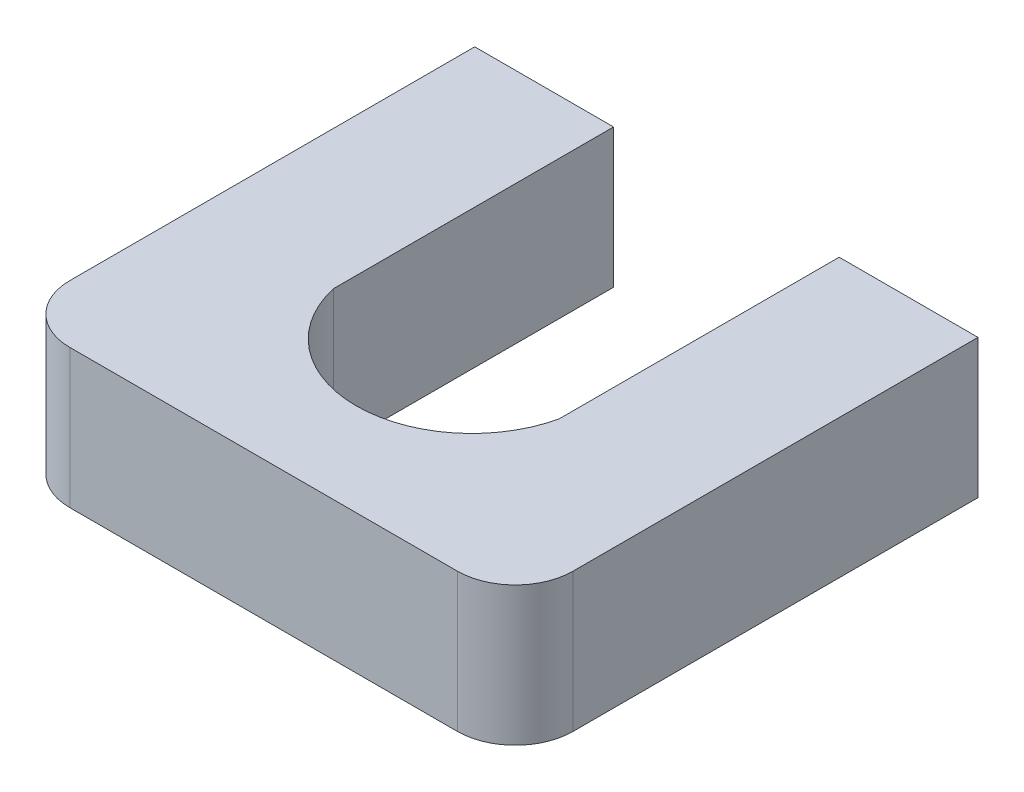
ISO-10303-21;
HEADER;
FILE_DESCRIPTION(('STEP AP214'),'2;1');
FILE_NAME('part.step','',(''),(''),'','','');
FILE_SCHEMA(('AUTOMOTIVE_DESIGN { 1 0 10303 214 1 1 1 1 }'));
ENDSEC;
DATA;
#1=APPLICATION_CONTEXT('core data for automotive mechanical design processes');
#2=APPLICATION_PROTOCOL_DEFINITION('international standard','automotive_design',2000,#1);
#3=PRODUCT_CONTEXT('',#1,'mechanical');
#4=PRODUCT('Part','Part','',(#3));
#5=PRODUCT_RELATED_PRODUCT_CATEGORY('part','',(#4));
#6=PRODUCT_DEFINITION_FORMATION('','',#4);
#7=PRODUCT_DEFINITION_CONTEXT('part definition',#1,'design');
#8=PRODUCT_DEFINITION('design','',#6,#7);
#9=PRODUCT_DEFINITION_SHAPE('','',#8);
#10=(LENGTH_UNIT() NAMED_UNIT(*) SI_UNIT(.MILLI.,.METRE.));
#11=(NAMED_UNIT(*) PLANE_ANGLE_UNIT() SI_UNIT($,.RADIAN.));
#12=(NAMED_UNIT(*) SI_UNIT($,.STERADIAN.) SOLID_ANGLE_UNIT());
#13=UNCERTAINTY_MEASURE_WITH_UNIT(LENGTH_MEASURE(1.E-05),#10,'distance_accuracy_value','');
#14=(GEOMETRIC_REPRESENTATION_CONTEXT(3) GLOBAL_UNCERTAINTY_ASSIGNED_CONTEXT((#13)) GLOBAL_UNIT_ASSIGNED_CONTEXT((#10,
#11,#12)) REPRESENTATION_CONTEXT('',''));
#15=CARTESIAN_POINT('',(0.,0.,0.));
#16=DIRECTION('',(0.,0.,1.));
#17=DIRECTION('',(1.,0.,0.));
#18=AXIS2_PLACEMENT_3D('',#15,#16,#17);
#19=CARTESIAN_POINT('',(-5.75,-6.,0.));
#20=DIRECTION('',(0.,0.,1.));
#21=DIRECTION('',(0.,-1.,0.));
#22=AXIS2_PLACEMENT_3D('',#19,#20,#21);
#23=PLANE('',#22);
#24=CARTESIAN_POINT('',(0.,0.,0.));
#25=DIRECTION('',(0.,0.,-1.));
#26=DIRECTION('',(-1.,0.,0.));
#27=AXIS2_PLACEMENT_3D('',#24,#25,#26);
#28=CIRCLE('',#27,2.5);
#29=CARTESIAN_POINT('',(-2.5,0.,0.));
#30=VERTEX_POINT('',#29);
#31=EDGE_CURVE('E248',#30,#30,#28,.T.);
#32=ORIENTED_EDGE('',*,*,#31,.F.);
#33=EDGE_LOOP('',(#32));
#34=FACE_BOUND('',#33,.T.);
#35=DIRECTION('',(0.,1.,0.));
#36=VECTOR('',#35,1.);
#37=CARTESIAN_POINT('',(6.25,-6.,0.));
#38=LINE('',#37,#36);
#39=CARTESIAN_POINT('',(6.25,-6.,0.));
#40=VERTEX_POINT('',#39);
#41=CARTESIAN_POINT('',(6.25,6.,0.));
#42=VERTEX_POINT('',#41);
#43=EDGE_CURVE('E168',#40,#42,#38,.T.);
#44=ORIENTED_EDGE('',*,*,#43,.F.);
#45=DIRECTION('',(1.,0.,0.));
#46=VECTOR('',#45,1.);
#47=CARTESIAN_POINT('',(-5.75,-6.,0.));
#48=LINE('',#47,#46);
#49=CARTESIAN_POINT('',(-5.75,-6.,0.));
#50=VERTEX_POINT('',#49);
#51=EDGE_CURVE('E144',#50,#40,#48,.T.);
#52=ORIENTED_EDGE('',*,*,#51,.F.);
#53=DIRECTION('',(0.,1.,0.));
#54=VECTOR('',#53,1.);
#55=CARTESIAN_POINT('',(-5.75,-6.,0.));
#56=LINE('',#55,#54);
#57=CARTESIAN_POINT('',(-5.75,6.,0.));
#58=VERTEX_POINT('',#57);
#59=EDGE_CURVE('E170',#50,#58,#56,.T.);
#60=ORIENTED_EDGE('',*,*,#59,.T.);
#61=DIRECTION('',(1.,0.,0.));
#62=VECTOR('',#61,1.);
#63=CARTESIAN_POINT('',(-5.75,6.,0.));
#64=LINE('',#63,#62);
#65=EDGE_CURVE('E118',#58,#42,#64,.T.);
#66=ORIENTED_EDGE('',*,*,#65,.T.);
#67=EDGE_LOOP('',(#44,#52,#60,#66));
#68=FACE_BOUND('',#67,.T.);
#69=ADVANCED_FACE('F14',(#34,#68),#23,.F.);
#70=CARTESIAN_POINT('',(32.75,-6.,35.));
#71=DIRECTION('',(0.,1.,0.));
#72=DIRECTION('',(-1.,0.,0.));
#73=AXIS2_PLACEMENT_3D('',#70,#71,#72);
#74=CYLINDRICAL_SURFACE('',#73,5.);
#75=DIRECTION('',(0.,1.,0.));
#76=VECTOR('',#75,1.);
#77=CARTESIAN_POINT('',(32.75,-6.,40.));
#78=LINE('',#77,#76);
#79=CARTESIAN_POINT('',(32.75,-6.,40.));
#80=VERTEX_POINT('',#79);
#81=CARTESIAN_POINT('',(32.75,6.,40.));
#82=VERTEX_POINT('',#81);
#83=EDGE_CURVE('E9',#80,#82,#78,.T.);
#84=ORIENTED_EDGE('',*,*,#83,.F.);
#85=CARTESIAN_POINT('',(32.75,-6.,35.));
#86=DIRECTION('',(0.,-1.,0.));
#87=DIRECTION('',(1.,0.,0.));
#88=AXIS2_PLACEMENT_3D('',#85,#86,#87);
#89=CIRCLE('',#88,5.);
#90=CARTESIAN_POINT('',(37.75,-6.,35.));
#91=VERTEX_POINT('',#90);
#92=EDGE_CURVE('E135',#91,#80,#89,.T.);
#93=ORIENTED_EDGE('',*,*,#92,.F.);
#94=DIRECTION('',(0.,1.,0.));
#95=VECTOR('',#94,1.);
#96=CARTESIAN_POINT('',(37.75,-6.,35.));
#97=LINE('',#96,#95);
#98=CARTESIAN_POINT('',(37.75,6.,35.));
#99=VERTEX_POINT('',#98);
#100=EDGE_CURVE('E29',#91,#99,#97,.T.);
#101=ORIENTED_EDGE('',*,*,#100,.T.);
#102=CARTESIAN_POINT('',(32.75,6.,35.));
#103=DIRECTION('',(0.,-1.,0.));
#104=DIRECTION('',(1.,0.,0.));
#105=AXIS2_PLACEMENT_3D('',#102,#103,#104);
#106=CIRCLE('',#105,5.);
#107=EDGE_CURVE('E101',#99,#82,#106,.T.);
#108=ORIENTED_EDGE('',*,*,#107,.T.);
#109=EDGE_LOOP('',(#84,#93,#101,#108));
#110=FACE_BOUND('',#109,.T.);
#111=ADVANCED_FACE('F102',(#110),#74,.T.);
#112=CARTESIAN_POINT('',(32.75,-6.,40.));
#113=DIRECTION('',(0.,0.,-1.));
#114=DIRECTION('',(0.,1.,0.));
#115=AXIS2_PLACEMENT_3D('',#112,#113,#114);
#116=PLANE('',#115);
#117=DIRECTION('',(0.,1.,0.));
#118=VECTOR('',#117,1.);
#119=CARTESIAN_POINT('',(-0.750000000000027,-6.,40.));
#120=LINE('',#119,#118);
#121=CARTESIAN_POINT('',(-0.750000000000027,-6.,40.));
#122=VERTEX_POINT('',#121);
#123=CARTESIAN_POINT('',(-0.750000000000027,6.,40.));
#124=VERTEX_POINT('',#123);
#125=EDGE_CURVE('E22',#122,#124,#120,.T.);
#126=ORIENTED_EDGE('',*,*,#125,.F.);
#127=DIRECTION('',(-1.,0.,0.));
#128=VECTOR('',#127,1.);
#129=CARTESIAN_POINT('',(32.75,-6.,40.));
#130=LINE('',#129,#128);
#131=EDGE_CURVE('E97',#80,#122,#130,.T.);
#132=ORIENTED_EDGE('',*,*,#131,.F.);
#133=ORIENTED_EDGE('',*,*,#83,.T.);
#134=DIRECTION('',(-1.,0.,0.));
#135=VECTOR('',#134,1.);
#136=CARTESIAN_POINT('',(32.75,6.,40.));
#137=LINE('',#136,#135);
#138=EDGE_CURVE('E94',#82,#124,#137,.T.);
#139=ORIENTED_EDGE('',*,*,#138,.T.);
#140=EDGE_LOOP('',(#126,#132,#133,#139));
#141=FACE_BOUND('',#140,.T.);
#142=ADVANCED_FACE('F16',(#141),#116,.F.);
#143=CARTESIAN_POINT('',(-0.750000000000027,-6.,35.));
#144=DIRECTION('',(0.,1.,0.));
#145=DIRECTION('',(-1.,0.,0.));
#146=AXIS2_PLACEMENT_3D('',#143,#144,#145);
#147=CYLINDRICAL_SURFACE('',#146,5.);
#148=DIRECTION('',(0.,1.,0.));
#149=VECTOR('',#148,1.);
#150=CARTESIAN_POINT('',(-5.75,-6.,35.));
#151=LINE('',#150,#149);
#152=CARTESIAN_POINT('',(-5.75,-6.,35.));
#153=VERTEX_POINT('',#152);
#154=CARTESIAN_POINT('',(-5.75,6.,35.));
#155=VERTEX_POINT('',#154);
#156=EDGE_CURVE('E172',#153,#155,#151,.T.);
#157=ORIENTED_EDGE('',*,*,#156,.F.);
#158=CARTESIAN_POINT('',(-0.750000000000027,-6.,35.));
#159=DIRECTION('',(0.,-1.,0.));
#160=DIRECTION('',(1.,0.,0.));
#161=AXIS2_PLACEMENT_3D('',#158,#159,#160);
#162=CIRCLE('',#161,5.);
#163=EDGE_CURVE('E138',#122,#153,#162,.T.);
#164=ORIENTED_EDGE('',*,*,#163,.F.);
#165=ORIENTED_EDGE('',*,*,#125,.T.);
#166=CARTESIAN_POINT('',(-0.750000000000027,6.,35.));
#167=DIRECTION('',(0.,-1.,0.));
#168=DIRECTION('',(1.,0.,0.));
#169=AXIS2_PLACEMENT_3D('',#166,#167,#168);
#170=CIRCLE('',#169,5.);
#171=EDGE_CURVE('E110',#124,#155,#170,.T.);
#172=ORIENTED_EDGE('',*,*,#171,.T.);
#173=EDGE_LOOP('',(#157,#164,#165,#172));
#174=FACE_BOUND('',#173,.T.);
#175=ADVANCED_FACE('F175',(#174),#147,.T.);
#176=CARTESIAN_POINT('',(-5.75,-6.,35.));
#177=DIRECTION('',(1.,0.,0.));
#178=DIRECTION('',(0.,1.,0.));
#179=AXIS2_PLACEMENT_3D('',#176,#177,#178);
#180=PLANE('',#179);
#181=ORIENTED_EDGE('',*,*,#59,.F.);
#182=DIRECTION('',(0.,0.,-1.));
#183=VECTOR('',#182,1.);
#184=CARTESIAN_POINT('',(-5.75,-6.,35.));
#185=LINE('',#184,#183);
#186=EDGE_CURVE('E141',#153,#50,#185,.T.);
#187=ORIENTED_EDGE('',*,*,#186,.F.);
#188=ORIENTED_EDGE('',*,*,#156,.T.);
#189=DIRECTION('',(0.,0.,-1.));
#190=VECTOR('',#189,1.);
#191=CARTESIAN_POINT('',(-5.75,6.,35.));
#192=LINE('',#191,#190);
#193=EDGE_CURVE('E112',#155,#58,#192,.T.);
#194=ORIENTED_EDGE('',*,*,#193,.T.);
#195=EDGE_LOOP('',(#181,#187,#188,#194));
#196=FACE_BOUND('',#195,.T.);
#197=ADVANCED_FACE('F198',(#196),#180,.F.);
#198=CARTESIAN_POINT('',(6.25,-6.,0.));
#199=DIRECTION('',(-1.,0.,0.));
#200=DIRECTION('',(0.,-1.,0.));
#201=AXIS2_PLACEMENT_3D('',#198,#199,#200);
#202=PLANE('',#201);
#203=DIRECTION('',(0.,1.,0.));
#204=VECTOR('',#203,1.);
#205=CARTESIAN_POINT('',(6.25,-6.,24.222048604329));
#206=LINE('',#205,#204);
#207=CARTESIAN_POINT('',(6.25,-6.,24.222048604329));
#208=VERTEX_POINT('',#207);
#209=CARTESIAN_POINT('',(6.25,6.,24.222048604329));
#210=VERTEX_POINT('',#209);
#211=EDGE_CURVE('E166',#208,#210,#206,.T.);
#212=ORIENTED_EDGE('',*,*,#211,.F.);
#213=DIRECTION('',(0.,0.,1.));
#214=VECTOR('',#213,1.);
#215=CARTESIAN_POINT('',(6.25,-6.,0.));
#216=LINE('',#215,#214);
#217=EDGE_CURVE('E147',#40,#208,#216,.T.);
#218=ORIENTED_EDGE('',*,*,#217,.F.);
#219=ORIENTED_EDGE('',*,*,#43,.T.);
#220=DIRECTION('',(0.,0.,1.));
#221=VECTOR('',#220,1.);
#222=CARTESIAN_POINT('',(6.25,6.,0.));
#223=LINE('',#222,#221);
#224=EDGE_CURVE('E121',#42,#210,#223,.T.);
#225=ORIENTED_EDGE('',*,*,#224,.T.);
#226=EDGE_LOOP('',(#212,#218,#219,#225));
#227=FACE_BOUND('',#226,.T.);
#228=ADVANCED_FACE('F193',(#227),#202,.F.);
#229=CARTESIAN_POINT('',(16.,-6.,22.));
#230=DIRECTION('',(0.,1.,0.));
#231=DIRECTION('',(-1.,0.,0.));
#232=AXIS2_PLACEMENT_3D('',#229,#230,#231);
#233=CYLINDRICAL_SURFACE('',#232,10.);
#234=DIRECTION('',(0.,1.,0.));
#235=VECTOR('',#234,1.);
#236=CARTESIAN_POINT('',(25.75,-6.,24.222048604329));
#237=LINE('',#236,#235);
#238=CARTESIAN_POINT('',(25.75,-6.,24.222048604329));
#239=VERTEX_POINT('',#238);
#240=CARTESIAN_POINT('',(25.75,6.,24.222048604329));
#241=VERTEX_POINT('',#240);
#242=EDGE_CURVE('E164',#239,#241,#237,.T.);
#243=ORIENTED_EDGE('',*,*,#242,.F.);
#244=CARTESIAN_POINT('',(16.,-6.,22.));
#245=DIRECTION('',(0.,-1.,0.));
#246=DIRECTION('',(1.,0.,0.));
#247=AXIS2_PLACEMENT_3D('',#244,#245,#246);
#248=CIRCLE('',#247,10.);
#249=EDGE_CURVE('E150',#239,#208,#248,.T.);
#250=ORIENTED_EDGE('',*,*,#249,.T.);
#251=ORIENTED_EDGE('',*,*,#211,.T.);
#252=CARTESIAN_POINT('',(16.,6.,22.));
#253=DIRECTION('',(0.,-1.,0.));
#254=DIRECTION('',(1.,0.,0.));
#255=AXIS2_PLACEMENT_3D('',#252,#253,#254);
#256=CIRCLE('',#255,10.);
#257=EDGE_CURVE('E124',#241,#210,#256,.T.);
#258=ORIENTED_EDGE('',*,*,#257,.F.);
#259=EDGE_LOOP('',(#243,#250,#251,#258));
#260=FACE_BOUND('',#259,.T.);
#261=ADVANCED_FACE('F190',(#260),#233,.F.);
#262=CARTESIAN_POINT('',(25.75,-6.,0.));
#263=DIRECTION('',(-1.,0.,0.));
#264=DIRECTION('',(0.,-1.,0.));
#265=AXIS2_PLACEMENT_3D('',#262,#263,#264);
#266=PLANE('',#265);
#267=DIRECTION('',(0.,1.,0.));
#268=VECTOR('',#267,1.);
#269=CARTESIAN_POINT('',(25.75,-6.,0.));
#270=LINE('',#269,#268);
#271=CARTESIAN_POINT('',(25.75,-6.,0.));
#272=VERTEX_POINT('',#271);
#273=CARTESIAN_POINT('',(25.75,6.,0.));
#274=VERTEX_POINT('',#273);
#275=EDGE_CURVE('E162',#272,#274,#270,.T.);
#276=ORIENTED_EDGE('',*,*,#275,.F.);
#277=DIRECTION('',(0.,0.,1.));
#278=VECTOR('',#277,1.);
#279=CARTESIAN_POINT('',(25.75,-6.,0.));
#280=LINE('',#279,#278);
#281=EDGE_CURVE('E153',#272,#239,#280,.T.);
#282=ORIENTED_EDGE('',*,*,#281,.T.);
#283=ORIENTED_EDGE('',*,*,#242,.T.);
#284=DIRECTION('',(0.,0.,1.));
#285=VECTOR('',#284,1.);
#286=CARTESIAN_POINT('',(25.75,6.,0.));
#287=LINE('',#286,#285);
#288=EDGE_CURVE('E127',#274,#241,#287,.T.);
#289=ORIENTED_EDGE('',*,*,#288,.F.);
#290=EDGE_LOOP('',(#276,#282,#283,#289));
#291=FACE_BOUND('',#290,.T.);
#292=ADVANCED_FACE('F187',(#291),#266,.T.);
#293=CARTESIAN_POINT('',(37.75,-6.,0.));
#294=DIRECTION('',(0.,0.,-1.));
#295=DIRECTION('',(0.,1.,0.));
#296=AXIS2_PLACEMENT_3D('',#293,#294,#295);
#297=PLANE('',#296);
#298=CARTESIAN_POINT('',(32.,0.,0.));
#299=DIRECTION('',(0.,0.,-1.));
#300=DIRECTION('',(-1.,0.,0.));
#301=AXIS2_PLACEMENT_3D('',#298,#299,#300);
#302=CIRCLE('',#301,2.5);
#303=CARTESIAN_POINT('',(29.5,0.,0.));
#304=VERTEX_POINT('',#303);
#305=EDGE_CURVE('E255',#304,#304,#302,.T.);
#306=ORIENTED_EDGE('',*,*,#305,.F.);
#307=EDGE_LOOP('',(#306));
#308=FACE_BOUND('',#307,.T.);
#309=DIRECTION('',(0.,1.,0.));
#310=VECTOR('',#309,1.);
#311=CARTESIAN_POINT('',(37.75,-6.,0.));
#312=LINE('',#311,#310);
#313=CARTESIAN_POINT('',(37.75,-6.,0.));
#314=VERTEX_POINT('',#313);
#315=CARTESIAN_POINT('',(37.75,6.,0.));
#316=VERTEX_POINT('',#315);
#317=EDGE_CURVE('E37',#314,#316,#312,.T.);
#318=ORIENTED_EDGE('',*,*,#317,.F.);
#319=DIRECTION('',(-1.,0.,0.));
#320=VECTOR('',#319,1.);
#321=CARTESIAN_POINT('',(37.75,-6.,0.));
#322=LINE('',#321,#320);
#323=EDGE_CURVE('E156',#314,#272,#322,.T.);
#324=ORIENTED_EDGE('',*,*,#323,.T.);
#325=ORIENTED_EDGE('',*,*,#275,.T.);
#326=DIRECTION('',(-1.,0.,0.));
#327=VECTOR('',#326,1.);
#328=CARTESIAN_POINT('',(37.75,6.,0.));
#329=LINE('',#328,#327);
#330=EDGE_CURVE('E130',#316,#274,#329,.T.);
#331=ORIENTED_EDGE('',*,*,#330,.F.);
#332=EDGE_LOOP('',(#318,#324,#325,#331));
#333=FACE_BOUND('',#332,.T.);
#334=ADVANCED_FACE('F182',(#308,#333),#297,.T.);
#335=CARTESIAN_POINT('',(37.75,-6.,35.));
#336=DIRECTION('',(1.,0.,0.));
#337=DIRECTION('',(0.,1.,0.));
#338=AXIS2_PLACEMENT_3D('',#335,#336,#337);
#339=PLANE('',#338);
#340=DIRECTION('',(0.,0.,-1.));
#341=VECTOR('',#340,1.);
#342=CARTESIAN_POINT('',(37.75,-6.,35.));
#343=LINE('',#342,#341);
#344=EDGE_CURVE('E158',#91,#314,#343,.T.);
#345=ORIENTED_EDGE('',*,*,#344,.T.);
#346=ORIENTED_EDGE('',*,*,#317,.T.);
#347=DIRECTION('',(0.,0.,-1.));
#348=VECTOR('',#347,1.);
#349=CARTESIAN_POINT('',(37.75,6.,35.));
#350=LINE('',#349,#348);
#351=EDGE_CURVE('E133',#99,#316,#350,.T.);
#352=ORIENTED_EDGE('',*,*,#351,.F.);
#353=ORIENTED_EDGE('',*,*,#100,.F.);
#354=EDGE_LOOP('',(#345,#346,#352,#353));
#355=FACE_BOUND('',#354,.T.);
#356=ADVANCED_FACE('F181',(#355),#339,.T.);
#357=CARTESIAN_POINT('',(32.75,-6.,35.));
#358=DIRECTION('',(0.,-1.,0.));
#359=DIRECTION('',(1.,0.,0.));
#360=AXIS2_PLACEMENT_3D('',#357,#358,#359);
#361=PLANE('',#360);
#362=ORIENTED_EDGE('',*,*,#92,.T.);
#363=ORIENTED_EDGE('',*,*,#131,.T.);
#364=ORIENTED_EDGE('',*,*,#163,.T.);
#365=ORIENTED_EDGE('',*,*,#186,.T.);
#366=ORIENTED_EDGE('',*,*,#51,.T.);
#367=ORIENTED_EDGE('',*,*,#217,.T.);
#368=ORIENTED_EDGE('',*,*,#249,.F.);
#369=ORIENTED_EDGE('',*,*,#281,.F.);
#370=ORIENTED_EDGE('',*,*,#323,.F.);
#371=ORIENTED_EDGE('',*,*,#344,.F.);
#372=EDGE_LOOP('',(#362,#363,#364,#365,#366,#367,#368,#369,#370,#371));
#373=FACE_BOUND('',#372,.T.);
#374=ADVANCED_FACE('F177',(#373),#361,.T.);
#375=CARTESIAN_POINT('',(32.75,6.,35.));
#376=DIRECTION('',(0.,-1.,0.));
#377=DIRECTION('',(1.,0.,0.));
#378=AXIS2_PLACEMENT_3D('',#375,#376,#377);
#379=PLANE('',#378);
#380=ORIENTED_EDGE('',*,*,#107,.F.);
#381=ORIENTED_EDGE('',*,*,#351,.T.);
#382=ORIENTED_EDGE('',*,*,#330,.T.);
#383=ORIENTED_EDGE('',*,*,#288,.T.);
#384=ORIENTED_EDGE('',*,*,#257,.T.);
#385=ORIENTED_EDGE('',*,*,#224,.F.);
#386=ORIENTED_EDGE('',*,*,#65,.F.);
#387=ORIENTED_EDGE('',*,*,#193,.F.);
#388=ORIENTED_EDGE('',*,*,#171,.F.);
#389=ORIENTED_EDGE('',*,*,#138,.F.);
#390=EDGE_LOOP('',(#380,#381,#382,#383,#384,#385,#386,#387,#388,#389));
#391=FACE_BOUND('',#390,.T.);
#392=ADVANCED_FACE('F107',(#391),#379,.F.);
#393=CARTESIAN_POINT('',(32.,0.,10.));
#394=DIRECTION('',(0.,0.,-1.));
#395=DIRECTION('',(-1.,0.,0.));
#396=AXIS2_PLACEMENT_3D('',#393,#394,#395);
#397=CYLINDRICAL_SURFACE('',#396,2.5);
#398=CARTESIAN_POINT('',(32.,0.,10.));
#399=DIRECTION('',(0.,0.,-1.));
#400=DIRECTION('',(-1.,0.,0.));
#401=AXIS2_PLACEMENT_3D('',#398,#399,#400);
#402=CIRCLE('',#401,2.5);
#403=CARTESIAN_POINT('',(29.5,0.,10.));
#404=VERTEX_POINT('',#403);
#405=EDGE_CURVE('E251',#404,#404,#402,.T.);
#406=ORIENTED_EDGE('',*,*,#405,.F.);
#407=EDGE_LOOP('',(#406));
#408=FACE_BOUND('',#407,.T.);
#409=ORIENTED_EDGE('',*,*,#305,.T.);
#410=EDGE_LOOP('',(#409));
#411=FACE_BOUND('',#410,.T.);
#412=ADVANCED_FACE('F229',(#408,#411),#397,.F.);
#413=CARTESIAN_POINT('',(32.,0.,10.));
#414=DIRECTION('',(0.,0.,-1.));
#415=DIRECTION('',(-1.,0.,0.));
#416=AXIS2_PLACEMENT_3D('',#413,#414,#415);
#417=PLANE('',#416);
#418=ORIENTED_EDGE('',*,*,#405,.T.);
#419=EDGE_LOOP('',(#418));
#420=FACE_BOUND('',#419,.T.);
#421=ADVANCED_FACE('F232',(#420),#417,.T.);
#422=CARTESIAN_POINT('',(0.,0.,10.));
#423=DIRECTION('',(0.,0.,-1.));
#424=DIRECTION('',(-1.,0.,0.));
#425=AXIS2_PLACEMENT_3D('',#422,#423,#424);
#426=CYLINDRICAL_SURFACE('',#425,2.5);
#427=CARTESIAN_POINT('',(0.,0.,10.));
#428=DIRECTION('',(0.,0.,-1.));
#429=DIRECTION('',(-1.,0.,0.));
#430=AXIS2_PLACEMENT_3D('',#427,#428,#429);
#431=CIRCLE('',#430,2.5);
#432=CARTESIAN_POINT('',(-2.5,0.,10.));
#433=VERTEX_POINT('',#432);
#434=EDGE_CURVE('E105',#433,#433,#431,.T.);
#435=ORIENTED_EDGE('',*,*,#434,.F.);
#436=EDGE_LOOP('',(#435));
#437=FACE_BOUND('',#436,.T.);
#438=ORIENTED_EDGE('',*,*,#31,.T.);
#439=EDGE_LOOP('',(#438));
#440=FACE_BOUND('',#439,.T.);
#441=ADVANCED_FACE('F236',(#437,#440),#426,.F.);
#442=CARTESIAN_POINT('',(0.,0.,10.));
#443=DIRECTION('',(0.,0.,-1.));
#444=DIRECTION('',(-1.,0.,0.));
#445=AXIS2_PLACEMENT_3D('',#442,#443,#444);
#446=PLANE('',#445);
#447=ORIENTED_EDGE('',*,*,#434,.T.);
#448=EDGE_LOOP('',(#447));
#449=FACE_BOUND('',#448,.T.);
#450=ADVANCED_FACE('F240',(#449),#446,.T.);
#451=CLOSED_SHELL('',(#69,#111,#142,#175,#197,#228,#261,#292,#334,#356,#374,#392,#412,#421,#441,#450));
#452=MANIFOLD_SOLID_BREP('B1',#451);
#453=ADVANCED_BREP_SHAPE_REPRESENTATION('',(#18,#452),#14);
#454=SHAPE_DEFINITION_REPRESENTATION(#9,#453);
ENDSEC;
END-ISO-10303-21;
